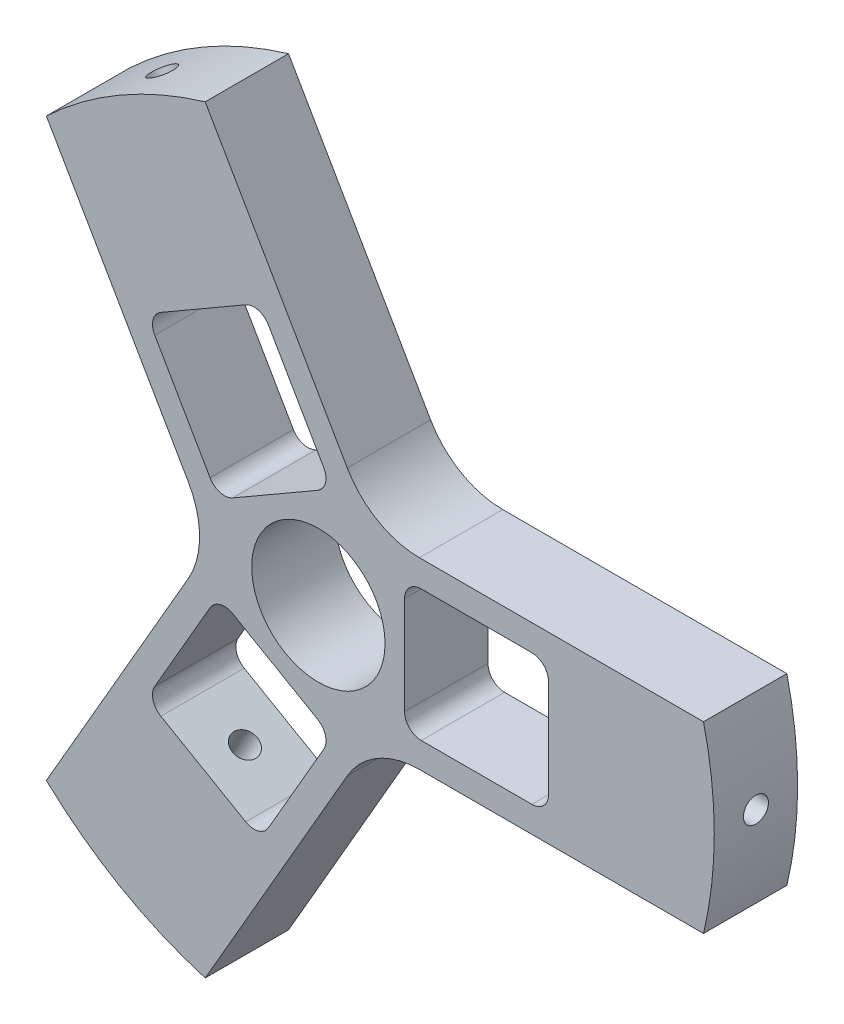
from build123d import *

# Parameters (mm, degrees)
ESQUISSE1_R                  = 8
BOSS_EXTRU_1_DEPTH           = 10
R_P_TITION_CIRCULAIRE1_COUNT = 3
ESQUISSE2_R                  = 1.5
ENL_V_MAT_EXTRU_1_DEPTH      = 71.298447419
CONG_1_R                     = 10
ENL_V_MAT_EXTRU_2_DEPTH      = 67.544234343
R_P_TITION_CIRCULAIRE2_COUNT = 3


with BuildPart() as part:
    # Esquisse1 → Boss.-Extru.1 (new body)
    with BuildSketch(Plane.XY):
        with BuildLine():
            Line((0, 11), (46.208765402, 11))
            ThreePointArc((46.208765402, 11), (47.5, 0), (46.208765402, -11))
            Line((46.208765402, -11), (0, -11))
            ThreePointArc((0, -11), (-11, 0), (0, 11))
        make_face()
        Circle(ESQUISSE1_R, mode=Mode.SUBTRACT)
    boss_extru_1 = extrude(amount=BOSS_EXTRU_1_DEPTH)

    # R_p_tition circulaire1: Boss.-Extru.1 ×3 about axis
    r_p_tition_circulaire1_axis = Axis((0, 0, 0), (0, 0, 1))
    for i in range(1, R_P_TITION_CIRCULAIRE1_COUNT):
        add(boss_extru_1.rotate(r_p_tition_circulaire1_axis, i * 360 / R_P_TITION_CIRCULAIRE1_COUNT))

    # Esquisse2 → Enl_v. mat.-Extru.1 (cut, through all)
    with BuildSketch(Plane(origin=(20, 0, 0), x_dir=(0, 0, -1), z_dir=(1, 0, 0))):
        with Locations(Location((-5, 0, 0), (0, 0, 180))):
            Circle(ESQUISSE2_R)
    enl_v_mat_extru_1 = extrude(amount=ENL_V_MAT_EXTRU_1_DEPTH, mode=Mode.SUBTRACT)

    # Cong_1
    cong_1_edges = [part.edges().sort_by_distance(p)[0] for p in [
        (6.350852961, 11, 5),
        (6.350852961, -11, 5),
        (-12.701705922, 0, 5),
    ]]
    fillet(cong_1_edges, radius=CONG_1_R)

    # Esquisse3 → Enl_v. mat.-Extru.2 (cut, through all)
    with BuildSketch(Plane.XY.offset(10)):
        with BuildLine():
            Line((12.346254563, 7.876632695), (25.619281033, 7.876632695))
            ThreePointArc((25.619281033, 7.876632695), (27.033494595, 7.290846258), (27.619281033, 5.876632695))
            Line((27.619281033, 5.876632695), (27.619281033, -5.876632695))
            ThreePointArc((27.619281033, -5.876632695), (27.033494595, -7.290846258), (25.619281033, -7.876632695))
            Line((25.619281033, -7.876632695), (12.346254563, -7.876632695))
            ThreePointArc((12.346254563, -7.876632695), (10.932041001, -7.290846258), (10.346254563, -5.876632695))
            Line((10.346254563, -5.876632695), (10.346254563, 5.876632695))
            ThreePointArc((10.346254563, 5.876632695), (10.932041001, 7.290846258), (12.346254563, 7.876632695))
        make_face()
    enl_v_mat_extru_2 = extrude(amount=-ENL_V_MAT_EXTRU_2_DEPTH, mode=Mode.SUBTRACT)

    # R_p_tition circulaire2: Enl_v. mat.-Extru.1, Enl_v. mat.-Extru.2 ×3 about axis
    r_p_tition_circulaire2_axis = Axis((0, 0, 0), (0, 0, 1))
    add([enl_v_mat_extru_1.rotate(r_p_tition_circulaire2_axis, i * 360 / R_P_TITION_CIRCULAIRE2_COUNT) for i in range(1, R_P_TITION_CIRCULAIRE2_COUNT)], mode=Mode.SUBTRACT)
    add([enl_v_mat_extru_2.rotate(r_p_tition_circulaire2_axis, i * 360 / R_P_TITION_CIRCULAIRE2_COUNT) for i in range(1, R_P_TITION_CIRCULAIRE2_COUNT)], mode=Mode.SUBTRACT)


solid = part.part
